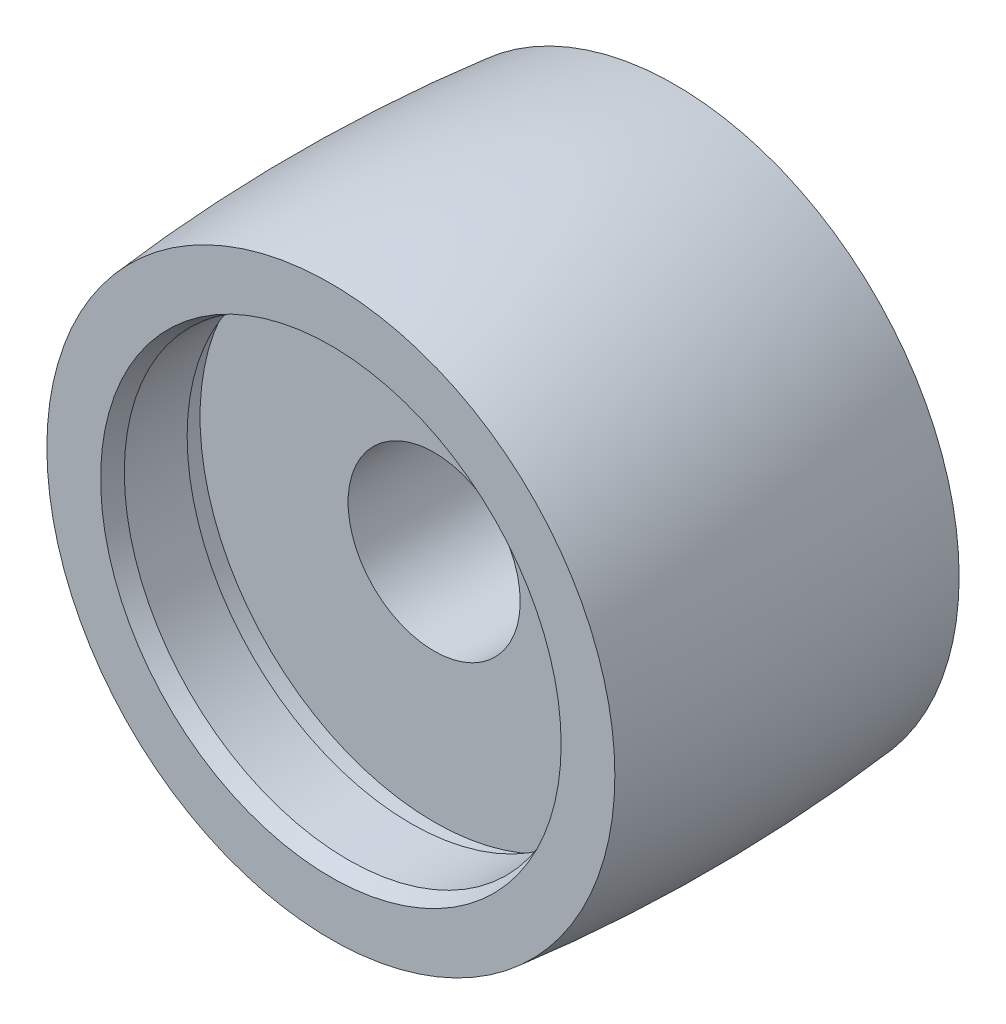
ISO-10303-21;
HEADER;
FILE_DESCRIPTION(('STEP AP214'),'2;1');
FILE_NAME('part.step','',(''),(''),'','','');
FILE_SCHEMA(('AUTOMOTIVE_DESIGN { 1 0 10303 214 1 1 1 1 }'));
ENDSEC;
DATA;
#1=APPLICATION_CONTEXT('core data for automotive mechanical design processes');
#2=APPLICATION_PROTOCOL_DEFINITION('international standard','automotive_design',2000,#1);
#3=PRODUCT_CONTEXT('',#1,'mechanical');
#4=PRODUCT('Part','Part','',(#3));
#5=PRODUCT_RELATED_PRODUCT_CATEGORY('part','',(#4));
#6=PRODUCT_DEFINITION_FORMATION('','',#4);
#7=PRODUCT_DEFINITION_CONTEXT('part definition',#1,'design');
#8=PRODUCT_DEFINITION('design','',#6,#7);
#9=PRODUCT_DEFINITION_SHAPE('','',#8);
#10=(LENGTH_UNIT() NAMED_UNIT(*) SI_UNIT(.MILLI.,.METRE.));
#11=(NAMED_UNIT(*) PLANE_ANGLE_UNIT() SI_UNIT($,.RADIAN.));
#12=(NAMED_UNIT(*) SI_UNIT($,.STERADIAN.) SOLID_ANGLE_UNIT());
#13=UNCERTAINTY_MEASURE_WITH_UNIT(LENGTH_MEASURE(1.E-05),#10,'distance_accuracy_value','');
#14=(GEOMETRIC_REPRESENTATION_CONTEXT(3) GLOBAL_UNCERTAINTY_ASSIGNED_CONTEXT((#13)) GLOBAL_UNIT_ASSIGNED_CONTEXT((#10,
#11,#12)) REPRESENTATION_CONTEXT('',''));
#15=CARTESIAN_POINT('',(0.,0.,0.));
#16=DIRECTION('',(0.,0.,1.));
#17=DIRECTION('',(1.,0.,0.));
#18=AXIS2_PLACEMENT_3D('',#15,#16,#17);
#19=CARTESIAN_POINT('',(-13.7632,-13.81055875,5.35));
#20=DIRECTION('',(0.,0.,1.));
#21=DIRECTION('',(1.,0.,0.));
#22=AXIS2_PLACEMENT_3D('',#19,#20,#21);
#23=PLANE('',#22);
#24=CARTESIAN_POINT('',(0.,0.,5.35));
#25=DIRECTION('',(0.,0.,1.));
#26=DIRECTION('',(0.,-1.,0.));
#27=AXIS2_PLACEMENT_3D('',#24,#25,#26);
#28=CIRCLE('',#27,13.);
#29=CARTESIAN_POINT('',(0.,-13.,5.35));
#30=VERTEX_POINT('',#29);
#31=EDGE_CURVE('E16',#30,#30,#28,.T.);
#32=ORIENTED_EDGE('',*,*,#31,.T.);
#33=EDGE_LOOP('',(#32));
#34=FACE_BOUND('',#33,.T.);
#35=CARTESIAN_POINT('',(0.,0.,5.35));
#36=DIRECTION('',(0.,0.,1.));
#37=DIRECTION('',(0.,-1.,0.));
#38=AXIS2_PLACEMENT_3D('',#35,#36,#37);
#39=CIRCLE('',#38,13.6);
#40=CARTESIAN_POINT('',(0.,-13.6,5.35));
#41=VERTEX_POINT('',#40);
#42=EDGE_CURVE('E46',#41,#41,#39,.F.);
#43=ORIENTED_EDGE('',*,*,#42,.T.);
#44=EDGE_LOOP('',(#43));
#45=FACE_BOUND('',#44,.T.);
#46=ADVANCED_FACE('F12',(#34,#45),#23,.F.);
#47=CARTESIAN_POINT('',(0.,0.,5.35));
#48=DIRECTION('',(0.,0.,1.));
#49=DIRECTION('',(0.,-1.,0.));
#50=AXIS2_PLACEMENT_3D('',#47,#48,#49);
#51=CYLINDRICAL_SURFACE('',#50,13.);
#52=ORIENTED_EDGE('',*,*,#31,.F.);
#53=EDGE_LOOP('',(#52));
#54=FACE_BOUND('',#53,.T.);
#55=CARTESIAN_POINT('',(0.,0.,9.));
#56=DIRECTION('',(0.,0.,1.));
#57=DIRECTION('',(1.,0.,0.));
#58=AXIS2_PLACEMENT_3D('',#55,#56,#57);
#59=CIRCLE('',#58,13.);
#60=CARTESIAN_POINT('',(13.,0.,8.99999999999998));
#61=VERTEX_POINT('',#60);
#62=EDGE_CURVE('E28',#61,#61,#59,.T.);
#63=ORIENTED_EDGE('',*,*,#62,.T.);
#64=EDGE_LOOP('',(#63));
#65=FACE_BOUND('',#64,.T.);
#66=ADVANCED_FACE('F55',(#54,#65),#51,.F.);
#67=CARTESIAN_POINT('',(0.,0.,4.));
#68=DIRECTION('',(0.,0.,1.));
#69=DIRECTION('',(0.,-1.,0.));
#70=AXIS2_PLACEMENT_3D('',#67,#68,#69);
#71=CYLINDRICAL_SURFACE('',#70,13.6);
#72=CARTESIAN_POINT('',(0.,0.,4.));
#73=DIRECTION('',(0.,0.,1.));
#74=DIRECTION('',(0.,-1.,0.));
#75=AXIS2_PLACEMENT_3D('',#72,#73,#74);
#76=CIRCLE('',#75,13.6);
#77=CARTESIAN_POINT('',(0.,-13.6,4.));
#78=VERTEX_POINT('',#77);
#79=EDGE_CURVE('E44',#78,#78,#76,.F.);
#80=ORIENTED_EDGE('',*,*,#79,.T.);
#81=EDGE_LOOP('',(#80));
#82=FACE_BOUND('',#81,.T.);
#83=ORIENTED_EDGE('',*,*,#42,.F.);
#84=EDGE_LOOP('',(#83));
#85=FACE_BOUND('',#84,.T.);
#86=ADVANCED_FACE('F58',(#82,#85),#71,.F.);
#87=CARTESIAN_POINT('',(0.,0.,9.));
#88=DIRECTION('',(0.,0.,1.));
#89=DIRECTION('',(1.,0.,0.));
#90=AXIS2_PLACEMENT_3D('',#87,#88,#89);
#91=CONICAL_SURFACE('',#90,13.,0.360829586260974);
#92=ORIENTED_EDGE('',*,*,#62,.F.);
#93=EDGE_LOOP('',(#92));
#94=FACE_BOUND('',#93,.T.);
#95=CARTESIAN_POINT('',(0.,0.,10.));
#96=DIRECTION('',(0.,0.,1.));
#97=DIRECTION('',(1.,0.,0.));
#98=AXIS2_PLACEMENT_3D('',#95,#96,#97);
#99=CIRCLE('',#98,13.377350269);
#100=CARTESIAN_POINT('',(13.377350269,0.,10.));
#101=VERTEX_POINT('',#100);
#102=EDGE_CURVE('E41',#101,#101,#99,.T.);
#103=ORIENTED_EDGE('',*,*,#102,.T.);
#104=EDGE_LOOP('',(#103));
#105=FACE_BOUND('',#104,.T.);
#106=ADVANCED_FACE('F62',(#94,#105),#91,.F.);
#107=CARTESIAN_POINT('',(13.7632,-13.81055875,4.));
#108=DIRECTION('',(0.,0.,-1.));
#109=DIRECTION('',(-1.,0.,0.));
#110=AXIS2_PLACEMENT_3D('',#107,#108,#109);
#111=PLANE('',#110);
#112=CARTESIAN_POINT('',(0.,0.,4.));
#113=DIRECTION('',(0.,0.,1.));
#114=DIRECTION('',(1.,0.,0.));
#115=AXIS2_PLACEMENT_3D('',#112,#113,#114);
#116=CIRCLE('',#115,5.);
#117=CARTESIAN_POINT('',(5.,0.,4.));
#118=VERTEX_POINT('',#117);
#119=EDGE_CURVE('E38',#118,#118,#116,.F.);
#120=ORIENTED_EDGE('',*,*,#119,.T.);
#121=EDGE_LOOP('',(#120));
#122=FACE_BOUND('',#121,.T.);
#123=ORIENTED_EDGE('',*,*,#79,.F.);
#124=EDGE_LOOP('',(#123));
#125=FACE_BOUND('',#124,.T.);
#126=ADVANCED_FACE('F65',(#122,#125),#111,.F.);
#127=CARTESIAN_POINT('',(16.696728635,-16.754181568,10.));
#128=DIRECTION('',(0.,0.,-1.));
#129=DIRECTION('',(-1.,0.,0.));
#130=AXIS2_PLACEMENT_3D('',#127,#128,#129);
#131=PLANE('',#130);
#132=ORIENTED_EDGE('',*,*,#102,.F.);
#133=EDGE_LOOP('',(#132));
#134=FACE_BOUND('',#133,.T.);
#135=CARTESIAN_POINT('',(0.,0.,9.99999999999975));
#136=DIRECTION('',(0.,0.,1.));
#137=DIRECTION('',(1.,0.,0.));
#138=AXIS2_PLACEMENT_3D('',#135,#136,#137);
#139=CIRCLE('',#138,16.498743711);
#140=CARTESIAN_POINT('',(16.498743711,0.,9.99999999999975));
#141=VERTEX_POINT('',#140);
#142=EDGE_CURVE('E35',#141,#141,#139,.F.);
#143=ORIENTED_EDGE('',*,*,#142,.F.);
#144=EDGE_LOOP('',(#143));
#145=FACE_BOUND('',#144,.T.);
#146=ADVANCED_FACE('F69',(#134,#145),#131,.F.);
#147=CARTESIAN_POINT('',(0.,0.,-4.));
#148=DIRECTION('',(0.,0.,1.));
#149=DIRECTION('',(1.,0.,0.));
#150=AXIS2_PLACEMENT_3D('',#147,#148,#149);
#151=CYLINDRICAL_SURFACE('',#150,5.);
#152=CARTESIAN_POINT('',(0.,0.,-4.));
#153=DIRECTION('',(0.,0.,1.));
#154=DIRECTION('',(1.,0.,0.));
#155=AXIS2_PLACEMENT_3D('',#152,#153,#154);
#156=CIRCLE('',#155,5.);
#157=CARTESIAN_POINT('',(5.,0.,-4.));
#158=VERTEX_POINT('',#157);
#159=EDGE_CURVE('E32',#158,#158,#156,.F.);
#160=ORIENTED_EDGE('',*,*,#159,.T.);
#161=EDGE_LOOP('',(#160));
#162=FACE_BOUND('',#161,.T.);
#163=ORIENTED_EDGE('',*,*,#119,.F.);
#164=EDGE_LOOP('',(#163));
#165=FACE_BOUND('',#164,.T.);
#166=ADVANCED_FACE('F72',(#162,#165),#151,.F.);
#167=CARTESIAN_POINT('',(0.,0.,0.));
#168=DIRECTION('',(0.,0.,1.));
#169=DIRECTION('',(1.,0.,0.));
#170=AXIS2_PLACEMENT_3D('',#167,#168,#169);
#171=DEGENERATE_TOROIDAL_SURFACE('',#170,83.0000000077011,100.000000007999,.F.);
#172=ORIENTED_EDGE('',*,*,#142,.T.);
#173=EDGE_LOOP('',(#172));
#174=FACE_BOUND('',#173,.T.);
#175=CARTESIAN_POINT('',(0.,0.,-10.0000000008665));
#176=DIRECTION('',(0.,0.,1.));
#177=DIRECTION('',(1.,0.,0.));
#178=AXIS2_PLACEMENT_3D('',#175,#176,#177);
#179=CIRCLE('',#178,16.4987437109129);
#180=CARTESIAN_POINT('',(16.4987437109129,0.,-10.0000000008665));
#181=VERTEX_POINT('',#180);
#182=EDGE_CURVE('E25',#181,#181,#179,.T.);
#183=ORIENTED_EDGE('',*,*,#182,.T.);
#184=EDGE_LOOP('',(#183));
#185=FACE_BOUND('',#184,.T.);
#186=ADVANCED_FACE('F76',(#174,#185),#171,.F.);
#187=CARTESIAN_POINT('',(-11.132,-11.170304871,-4.));
#188=DIRECTION('',(0.,0.,1.));
#189=DIRECTION('',(1.,0.,0.));
#190=AXIS2_PLACEMENT_3D('',#187,#188,#189);
#191=PLANE('',#190);
#192=ORIENTED_EDGE('',*,*,#159,.F.);
#193=EDGE_LOOP('',(#192));
#194=FACE_BOUND('',#193,.T.);
#195=CARTESIAN_POINT('',(0.,0.,-4.));
#196=DIRECTION('',(0.,0.,1.));
#197=DIRECTION('',(1.,0.,0.));
#198=AXIS2_PLACEMENT_3D('',#195,#196,#197);
#199=CIRCLE('',#198,11.);
#200=CARTESIAN_POINT('',(11.,0.,-4.));
#201=VERTEX_POINT('',#200);
#202=EDGE_CURVE('E20',#201,#201,#199,.F.);
#203=ORIENTED_EDGE('',*,*,#202,.T.);
#204=EDGE_LOOP('',(#203));
#205=FACE_BOUND('',#204,.T.);
#206=ADVANCED_FACE('F79',(#194,#205),#191,.F.);
#207=CARTESIAN_POINT('',(-16.696728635,-16.754181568,-10.));
#208=DIRECTION('',(0.,0.,1.));
#209=DIRECTION('',(1.,0.,0.));
#210=AXIS2_PLACEMENT_3D('',#207,#208,#209);
#211=PLANE('',#210);
#212=CARTESIAN_POINT('',(0.,0.,-10.));
#213=DIRECTION('',(0.,0.,1.));
#214=DIRECTION('',(1.,0.,0.));
#215=AXIS2_PLACEMENT_3D('',#212,#213,#214);
#216=CIRCLE('',#215,11.);
#217=CARTESIAN_POINT('',(11.,0.,-10.));
#218=VERTEX_POINT('',#217);
#219=EDGE_CURVE('E8',#218,#218,#216,.T.);
#220=ORIENTED_EDGE('',*,*,#219,.T.);
#221=EDGE_LOOP('',(#220));
#222=FACE_BOUND('',#221,.T.);
#223=ORIENTED_EDGE('',*,*,#182,.F.);
#224=EDGE_LOOP('',(#223));
#225=FACE_BOUND('',#224,.T.);
#226=ADVANCED_FACE('F14',(#222,#225),#211,.F.);
#227=CARTESIAN_POINT('',(0.,0.,-10.));
#228=DIRECTION('',(0.,0.,1.));
#229=DIRECTION('',(1.,0.,0.));
#230=AXIS2_PLACEMENT_3D('',#227,#228,#229);
#231=CYLINDRICAL_SURFACE('',#230,11.);
#232=ORIENTED_EDGE('',*,*,#202,.F.);
#233=EDGE_LOOP('',(#232));
#234=FACE_BOUND('',#233,.T.);
#235=ORIENTED_EDGE('',*,*,#219,.F.);
#236=EDGE_LOOP('',(#235));
#237=FACE_BOUND('',#236,.T.);
#238=ADVANCED_FACE('F84',(#234,#237),#231,.F.);
#239=CLOSED_SHELL('',(#46,#66,#86,#106,#126,#146,#166,#186,#206,#226,#238));
#240=MANIFOLD_SOLID_BREP('B1',#239);
#241=ADVANCED_BREP_SHAPE_REPRESENTATION('',(#18,#240),#14);
#242=SHAPE_DEFINITION_REPRESENTATION(#9,#241);
ENDSEC;
END-ISO-10303-21;
